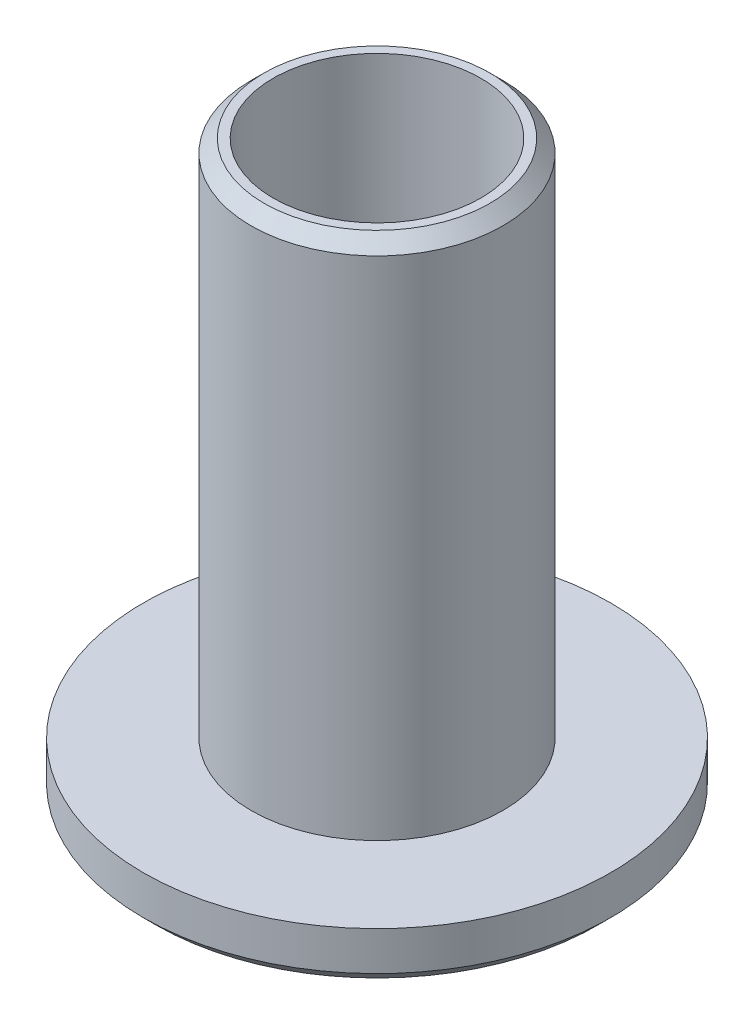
from build123d import *

# Parameters (mm, degrees)
SKIZZE1_R                       = 9
SKIZZE1_R_2                     = 4
AUFSATZ_LINEAR_AUSTRAGEN1_DEPTH = 2
SKIZZE2_R                       = 4.85
SKIZZE2_R_2                     = 4
AUFSATZ_LINEAR_AUSTRAGEN2_DEPTH = 20
FASE1_SIZE                      = 0.5


with BuildPart() as part:
    # Skizze1 → Aufsatz-Linear austragen1 (new body)
    with BuildSketch(Plane(origin=(0, 0, 0), x_dir=(1, 0, 0), z_dir=(0, 1, 0))):
        with Locations(Location((0, 0, 0), (0, 0, 270))):
            Circle(SKIZZE1_R)
        with Locations(Location((0, 0, 0), (0, 0, 270))):
            Circle(SKIZZE1_R_2, mode=Mode.SUBTRACT)
    extrude(amount=AUFSATZ_LINEAR_AUSTRAGEN1_DEPTH)

    # Skizze2 → Aufsatz-Linear austragen2 (add)
    with BuildSketch(Plane(origin=(0, 2, 0), x_dir=(1, 0, 0), z_dir=(0, 1, 0))):
        with Locations(Location((0, 0, 0), (0, 0, 270))):
            Circle(SKIZZE2_R)
        with Locations(Location((0, 0, 0), (0, 0, 270))):
            Circle(SKIZZE2_R_2, mode=Mode.SUBTRACT)
    extrude(amount=AUFSATZ_LINEAR_AUSTRAGEN2_DEPTH)

    # Fase1
    fase1_edges = [part.edges().sort_by_distance(p)[0] for p in [
        (0, 22, -4.85),
        (0, 0, -9),
    ]]
    chamfer(fase1_edges, length=FASE1_SIZE)


solid = part.part
